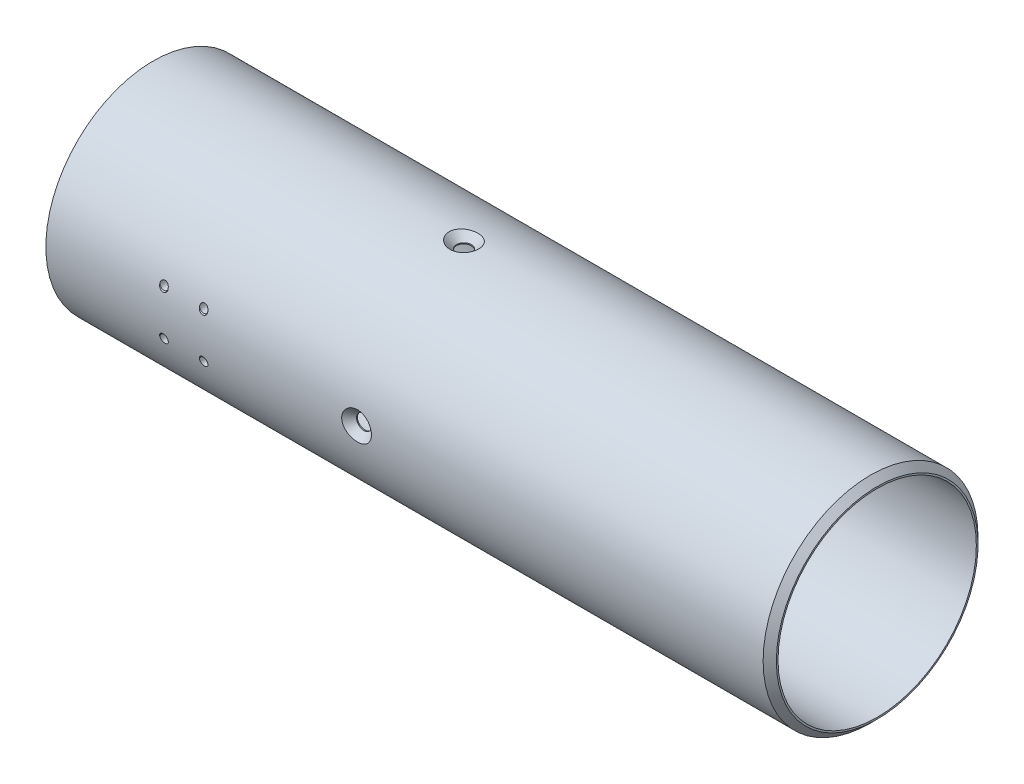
from build123d import *

# Parameters (mm, degrees)
R_P_TITION_CIRCULAIRE1_COUNT    = 4
ESQUISSE5_R                     = 32.5
ESQUISSE5_R_2                   = 30
EXTRUSION1_DEPTH                = 115
TROU_TARAUD_M3X0_51_D           = 2.5
TROU_TARAUD_M3X0_51_DEPTH       = 7.5
TROU_TARAUD_M3X0_51_CSINK_D     = 4
TROU_TARAUD_M3X0_51_CSINK_ANGLE = 90
TROU_TARAUD_M3X0_51_TIP         = 0.721687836
CHANFREIN1_SIZE                 = 2


with BuildPart() as part:
    # Esquisse1 → R_volution1 (revolve)
    with BuildSketch(Plane.XY, mode=Mode.PRIVATE) as r_volution1_sk:
        Polygon((-104, 30.5), (-104, 32.5), (0, 32.5), (0, 30), (-88, 30), (-88, 30.5), align=None)
    revolve(r_volution1_sk.sketch.rotate(Axis((0, 0, 0), (-1, 0, 0)), 90), axis=Axis((0, 0, 0), (-1, 0, 0)))

    # Esquisse3 → Fraisage pour vis _ t_te frais_e _ 6 pan (revolve, cut)
    with BuildSketch(Plane(origin=(-10, 0, 32.5), x_dir=(0, -1, 0), z_dir=(1, 0, 0))):
        Polygon((0, 0), (0, 13.351936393), (2.25, 12), (2.25, 2.25), (4.5, 0), align=None)
    fraisage_pour_vis_t_te_frais_e_6_pan = revolve(axis=Axis((-10, 0, 38.85), (0, 0, -1)), mode=Mode.SUBTRACT)

    # R_p_tition circulaire1: Fraisage pour vis _ t_te frais_e _ 6 pan ×4 about axis
    r_p_tition_circulaire1_axis = Axis((-88, 0, 0), (1, 0, 0))
    for i in range(1, R_P_TITION_CIRCULAIRE1_COUNT):
        add(fraisage_pour_vis_t_te_frais_e_6_pan.rotate(r_p_tition_circulaire1_axis, i * 360 / R_P_TITION_CIRCULAIRE1_COUNT), mode=Mode.SUBTRACT)

    # Esquisse5 → Extrusion1 (add)
    with BuildSketch(Plane(origin=(0, 0, 0), x_dir=(0, 0, -1), z_dir=(1, 0, 0))):
        Circle(ESQUISSE5_R)
        Circle(ESQUISSE5_R_2, mode=Mode.SUBTRACT)
    extrude(amount=EXTRUSION1_DEPTH)

    # Trou taraud_ M3x0.51
    with Locations(Plane.XY.offset(32.5)):
        with Locations((-69, 7), (-69, -7), (-57, -7), (-57, 7)):
            CounterSinkHole(TROU_TARAUD_M3X0_51_D / 2, TROU_TARAUD_M3X0_51_CSINK_D / 2, depth=TROU_TARAUD_M3X0_51_DEPTH, counter_sink_angle=TROU_TARAUD_M3X0_51_CSINK_ANGLE)
            with Locations((0, 0, -(TROU_TARAUD_M3X0_51_DEPTH + TROU_TARAUD_M3X0_51_TIP / 2))):  # 120° drill point
                Cone(0, TROU_TARAUD_M3X0_51_D / 2, TROU_TARAUD_M3X0_51_TIP, mode=Mode.SUBTRACT)

    # Chanfrein1
    chanfrein1_edges = [part.edges().sort_by_distance(p)[0] for p in [
        (115, 0, 32.5),
    ]]
    chamfer(chanfrein1_edges, length=CHANFREIN1_SIZE)


solid = part.part
